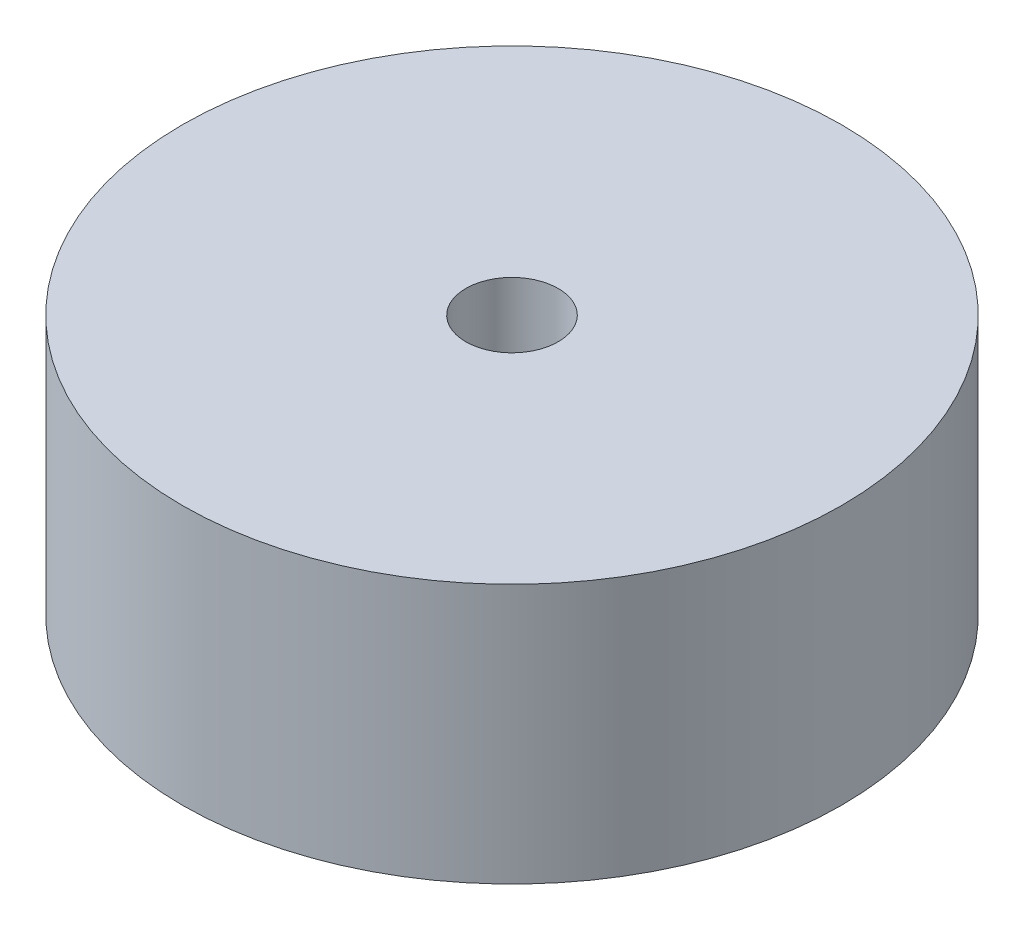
ISO-10303-21;
HEADER;
FILE_DESCRIPTION(('STEP AP214'),'2;1');
FILE_NAME('part.step','',(''),(''),'','','');
FILE_SCHEMA(('AUTOMOTIVE_DESIGN { 1 0 10303 214 1 1 1 1 }'));
ENDSEC;
DATA;
#1=APPLICATION_CONTEXT('core data for automotive mechanical design processes');
#2=APPLICATION_PROTOCOL_DEFINITION('international standard','automotive_design',2000,#1);
#3=PRODUCT_CONTEXT('',#1,'mechanical');
#4=PRODUCT('Part','Part','',(#3));
#5=PRODUCT_RELATED_PRODUCT_CATEGORY('part','',(#4));
#6=PRODUCT_DEFINITION_FORMATION('','',#4);
#7=PRODUCT_DEFINITION_CONTEXT('part definition',#1,'design');
#8=PRODUCT_DEFINITION('design','',#6,#7);
#9=PRODUCT_DEFINITION_SHAPE('','',#8);
#10=(LENGTH_UNIT() NAMED_UNIT(*) SI_UNIT(.MILLI.,.METRE.));
#11=(NAMED_UNIT(*) PLANE_ANGLE_UNIT() SI_UNIT($,.RADIAN.));
#12=(NAMED_UNIT(*) SI_UNIT($,.STERADIAN.) SOLID_ANGLE_UNIT());
#13=UNCERTAINTY_MEASURE_WITH_UNIT(LENGTH_MEASURE(1.E-05),#10,'distance_accuracy_value','');
#14=(GEOMETRIC_REPRESENTATION_CONTEXT(3) GLOBAL_UNCERTAINTY_ASSIGNED_CONTEXT((#13)) GLOBAL_UNIT_ASSIGNED_CONTEXT((#10,
#11,#12)) REPRESENTATION_CONTEXT('',''));
#15=CARTESIAN_POINT('',(0.,0.,0.));
#16=DIRECTION('',(0.,0.,1.));
#17=DIRECTION('',(1.,0.,0.));
#18=AXIS2_PLACEMENT_3D('',#15,#16,#17);
#19=CARTESIAN_POINT('',(-10.5433734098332,5.,-3.57101629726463));
#20=DIRECTION('',(0.,-1.,0.));
#21=DIRECTION('',(0.,0.,-1.));
#22=AXIS2_PLACEMENT_3D('',#19,#20,#21);
#23=CYLINDRICAL_SURFACE('',#22,6.35);
#24=CARTESIAN_POINT('',(-10.5433734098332,5.,-3.57101629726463));
#25=DIRECTION('',(0.,1.,0.));
#26=DIRECTION('',(0.,0.,1.));
#27=AXIS2_PLACEMENT_3D('',#24,#25,#26);
#28=CIRCLE('',#27,6.35);
#29=CARTESIAN_POINT('',(-10.5433734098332,5.,2.77898370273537));
#30=VERTEX_POINT('',#29);
#31=EDGE_CURVE('E10',#30,#30,#28,.T.);
#32=ORIENTED_EDGE('',*,*,#31,.F.);
#33=EDGE_LOOP('',(#32));
#34=FACE_BOUND('',#33,.T.);
#35=CARTESIAN_POINT('',(-10.5433734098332,0.,-3.57101629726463));
#36=DIRECTION('',(0.,1.,0.));
#37=DIRECTION('',(0.,0.,1.));
#38=AXIS2_PLACEMENT_3D('',#35,#36,#37);
#39=CIRCLE('',#38,6.35);
#40=CARTESIAN_POINT('',(-10.5433734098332,0.,2.77898370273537));
#41=VERTEX_POINT('',#40);
#42=EDGE_CURVE('E38',#41,#41,#39,.T.);
#43=ORIENTED_EDGE('',*,*,#42,.T.);
#44=EDGE_LOOP('',(#43));
#45=FACE_BOUND('',#44,.T.);
#46=ADVANCED_FACE('F31',(#34,#45),#23,.T.);
#47=CARTESIAN_POINT('',(-10.5433734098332,5.,-3.57101629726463));
#48=DIRECTION('',(0.,1.,0.));
#49=DIRECTION('',(0.,0.,1.));
#50=AXIS2_PLACEMENT_3D('',#47,#48,#49);
#51=PLANE('',#50);
#52=CARTESIAN_POINT('',(-10.5433734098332,5.,-3.57101629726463));
#53=DIRECTION('',(0.,1.,0.));
#54=DIRECTION('',(0.,0.,1.));
#55=AXIS2_PLACEMENT_3D('',#52,#53,#54);
#56=CIRCLE('',#55,0.89);
#57=CARTESIAN_POINT('',(-10.5433734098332,5.,-2.68101629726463));
#58=VERTEX_POINT('',#57);
#59=EDGE_CURVE('E44',#58,#58,#56,.T.);
#60=ORIENTED_EDGE('',*,*,#59,.F.);
#61=EDGE_LOOP('',(#60));
#62=FACE_BOUND('',#61,.T.);
#63=ORIENTED_EDGE('',*,*,#31,.T.);
#64=EDGE_LOOP('',(#63));
#65=FACE_BOUND('',#64,.T.);
#66=ADVANCED_FACE('F60',(#62,#65),#51,.T.);
#67=CARTESIAN_POINT('',(-10.5433734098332,0.,-3.57101629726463));
#68=DIRECTION('',(0.,1.,0.));
#69=DIRECTION('',(0.,0.,1.));
#70=AXIS2_PLACEMENT_3D('',#67,#68,#69);
#71=PLANE('',#70);
#72=CARTESIAN_POINT('',(-10.5433734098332,0.,-3.57101629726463));
#73=DIRECTION('',(0.,1.,0.));
#74=DIRECTION('',(0.,0.,1.));
#75=AXIS2_PLACEMENT_3D('',#72,#73,#74);
#76=CIRCLE('',#75,0.89);
#77=CARTESIAN_POINT('',(-10.5433734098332,0.,-2.68101629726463));
#78=VERTEX_POINT('',#77);
#79=EDGE_CURVE('E34',#78,#78,#76,.T.);
#80=ORIENTED_EDGE('',*,*,#79,.T.);
#81=EDGE_LOOP('',(#80));
#82=FACE_BOUND('',#81,.T.);
#83=ORIENTED_EDGE('',*,*,#42,.F.);
#84=EDGE_LOOP('',(#83));
#85=FACE_BOUND('',#84,.T.);
#86=ADVANCED_FACE('F51',(#82,#85),#71,.F.);
#87=CARTESIAN_POINT('',(-10.5433734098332,-3.,-3.57101629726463));
#88=DIRECTION('',(0.,1.,0.));
#89=DIRECTION('',(0.,0.,1.));
#90=AXIS2_PLACEMENT_3D('',#87,#88,#89);
#91=CYLINDRICAL_SURFACE('',#90,0.89);
#92=ORIENTED_EDGE('',*,*,#59,.T.);
#93=EDGE_LOOP('',(#92));
#94=FACE_BOUND('',#93,.T.);
#95=ORIENTED_EDGE('',*,*,#79,.F.);
#96=EDGE_LOOP('',(#95));
#97=FACE_BOUND('',#96,.T.);
#98=ADVANCED_FACE('F54',(#94,#97),#91,.F.);
#99=CLOSED_SHELL('',(#46,#66,#86,#98));
#100=MANIFOLD_SOLID_BREP('B2',#99);
#101=ADVANCED_BREP_SHAPE_REPRESENTATION('',(#18,#100),#14);
#102=SHAPE_DEFINITION_REPRESENTATION(#9,#101);
ENDSEC;
END-ISO-10303-21;
